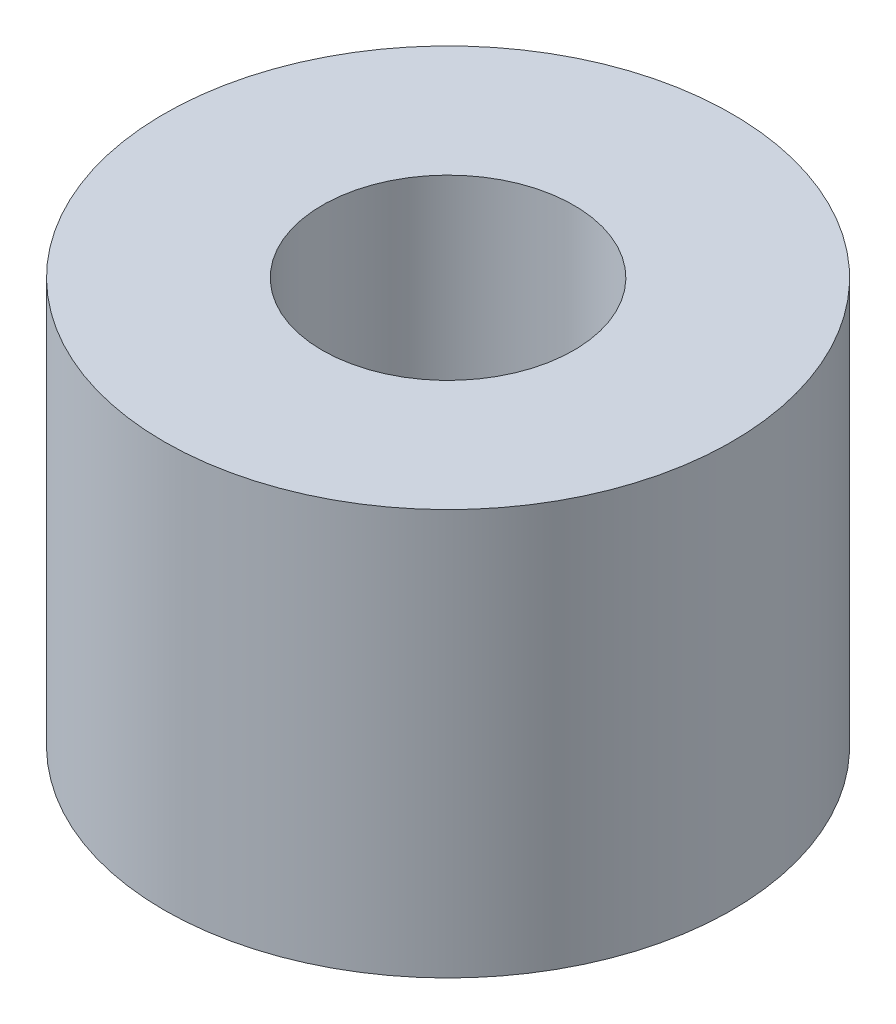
from build123d import *

# Parameters (mm, degrees)
SKETCH1_R           = 3.5
SKETCH1_R_2         = 1.55
BOSS_EXTRUDE1_DEPTH = 5


with BuildPart() as part:
    # Sketch1 → Boss-Extrude1 (new body)
    with BuildSketch(Plane(origin=(0, 0, 0), x_dir=(1, 0, 0), z_dir=(0, 1, 0))):
        with Locations(Location((0, 0, 0), (0, 0, 270))):
            Circle(SKETCH1_R)
        with Locations(Location((0, 0, 0), (0, 0, 270))):
            Circle(SKETCH1_R_2, mode=Mode.SUBTRACT)
    extrude(amount=BOSS_EXTRUDE1_DEPTH)


solid = part.part
